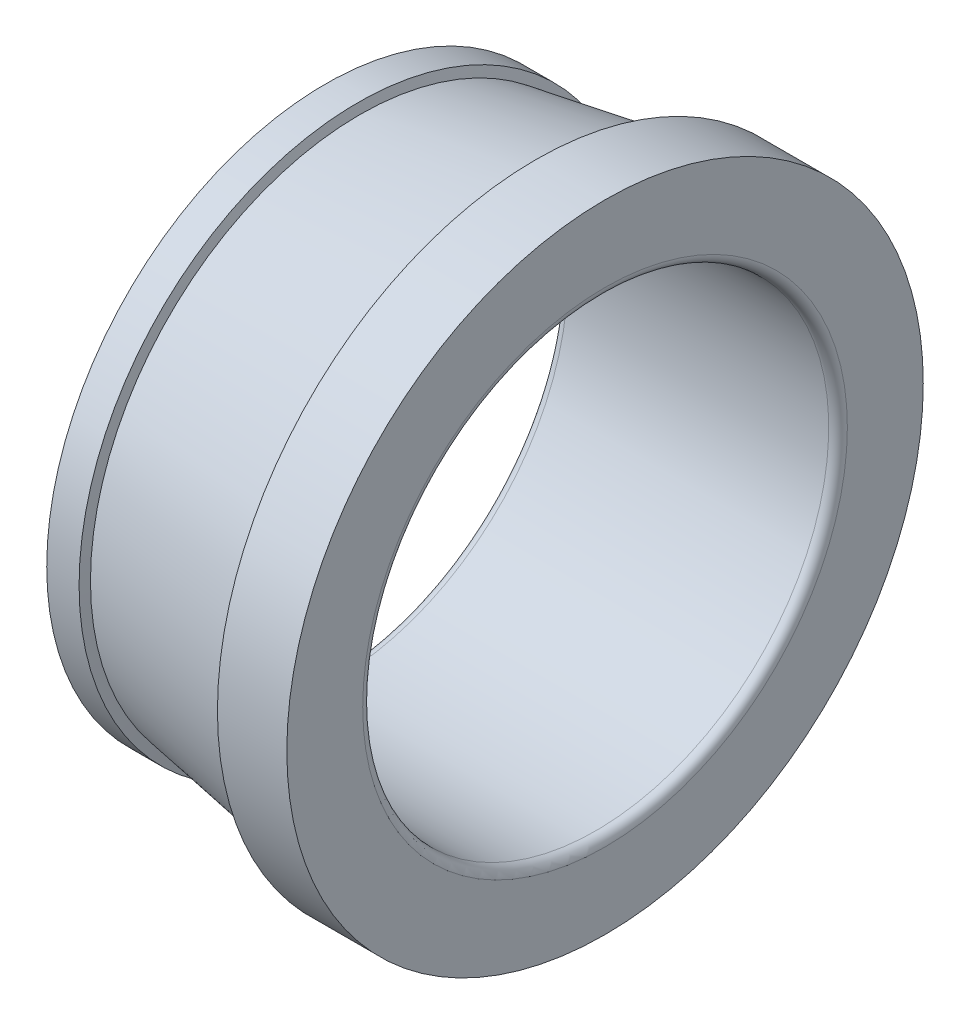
from build123d import *


with BuildPart() as part:
    # Esquisse1 → Base-R_volution (revolve)
    with BuildSketch(Plane(origin=(0, 0, 0), x_dir=(1, 0, 0), z_dir=(0, 1, 0)), mode=Mode.PRIVATE) as base_r_volution_sk:
        with BuildLine():
            Line((14.5, 12.5), (0.5, 12.5))
            ThreePointArc((0.5, 12.5), (0.146446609, 12.646446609), (0, 13))
            Line((0, 13), (0, 14.951217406))
            Line((0, 14.951217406), (1.734456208, 14.951217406))
            Line((1.734456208, 14.951217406), (1.845567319, 14.451217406))
            Line((1.845567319, 14.451217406), (11.5, 16.07180586))
            Line((11.5, 16.07180586), (11.277777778, 17.07180586))
            Line((11.277777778, 17.07180586), (15, 17.07180586))
            Line((15, 17.07180586), (15, 13))
            ThreePointArc((15, 13), (14.853553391, 12.646446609), (14.5, 12.5))
        make_face()
    revolve(base_r_volution_sk.sketch.rotate(Axis((0, 0, 0), (1, 0, 0)), 180), axis=Axis((0, 0, 0), (1, 0, 0)))


solid = part.part
